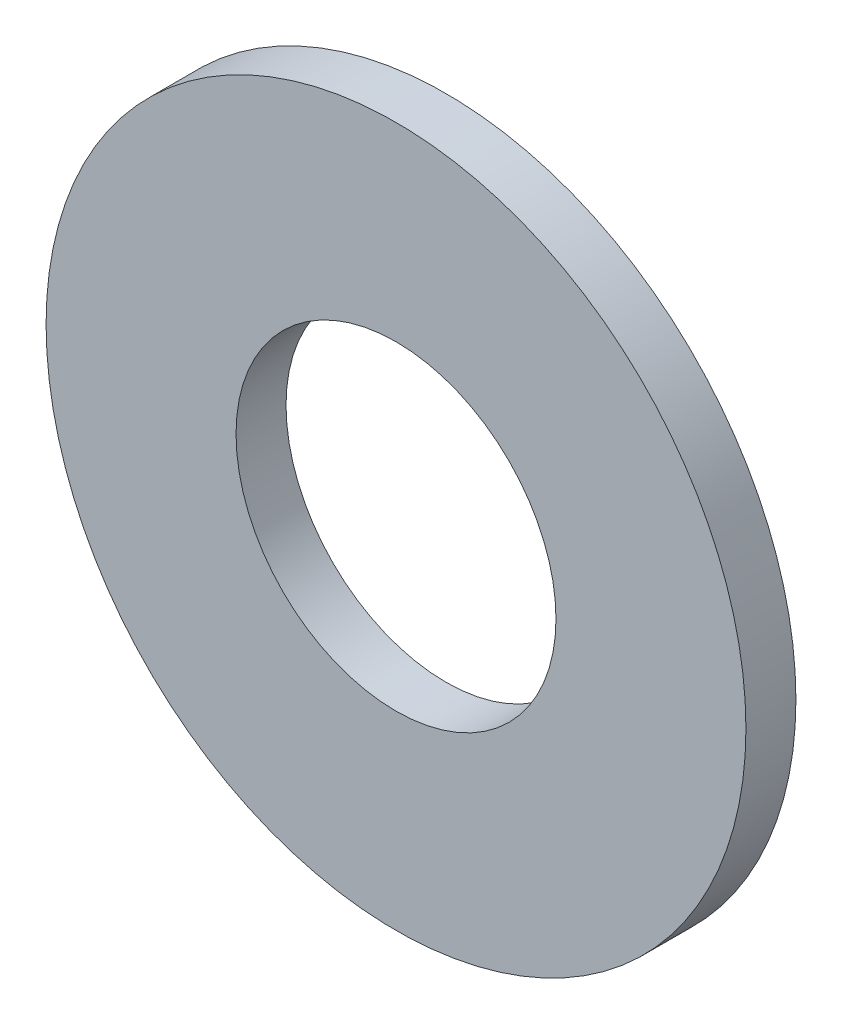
from build123d import *

# Parameters (mm, degrees)
SKETCH_1_R            = 3.5
SKETCH_1_R_2          = 1.6
WASHER_ENVELOPE_DEPTH = 0.5


with BuildPart() as part:
    # Sketch 1 → Washer_envelope (new body)
    with BuildSketch(Plane.XY):
        Circle(SKETCH_1_R)
        Circle(SKETCH_1_R_2, mode=Mode.SUBTRACT)
    extrude(amount=WASHER_ENVELOPE_DEPTH)


solid = part.part
